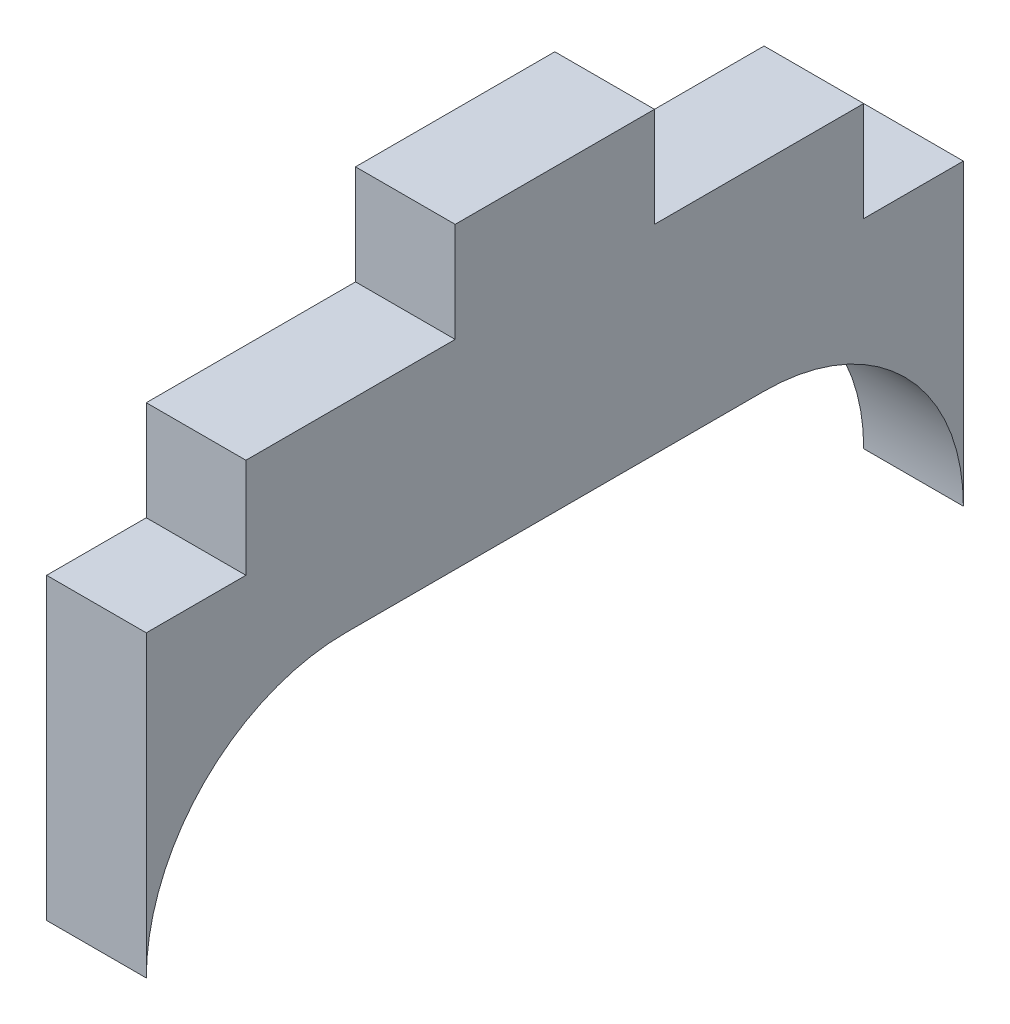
ISO-10303-21;
HEADER;
FILE_DESCRIPTION(('STEP AP214'),'2;1');
FILE_NAME('part.step','',(''),(''),'','','');
FILE_SCHEMA(('AUTOMOTIVE_DESIGN { 1 0 10303 214 1 1 1 1 }'));
ENDSEC;
DATA;
#1=APPLICATION_CONTEXT('core data for automotive mechanical design processes');
#2=APPLICATION_PROTOCOL_DEFINITION('international standard','automotive_design',2000,#1);
#3=PRODUCT_CONTEXT('',#1,'mechanical');
#4=PRODUCT('Part','Part','',(#3));
#5=PRODUCT_RELATED_PRODUCT_CATEGORY('part','',(#4));
#6=PRODUCT_DEFINITION_FORMATION('','',#4);
#7=PRODUCT_DEFINITION_CONTEXT('part definition',#1,'design');
#8=PRODUCT_DEFINITION('design','',#6,#7);
#9=PRODUCT_DEFINITION_SHAPE('','',#8);
#10=(LENGTH_UNIT() NAMED_UNIT(*) SI_UNIT(.MILLI.,.METRE.));
#11=(NAMED_UNIT(*) PLANE_ANGLE_UNIT() SI_UNIT($,.RADIAN.));
#12=(NAMED_UNIT(*) SI_UNIT($,.STERADIAN.) SOLID_ANGLE_UNIT());
#13=UNCERTAINTY_MEASURE_WITH_UNIT(LENGTH_MEASURE(1.E-05),#10,'distance_accuracy_value','');
#14=(GEOMETRIC_REPRESENTATION_CONTEXT(3) GLOBAL_UNCERTAINTY_ASSIGNED_CONTEXT((#13)) GLOBAL_UNIT_ASSIGNED_CONTEXT((#10,
#11,#12)) REPRESENTATION_CONTEXT('',''));
#15=CARTESIAN_POINT('',(0.,0.,0.));
#16=DIRECTION('',(0.,0.,1.));
#17=DIRECTION('',(1.,0.,0.));
#18=AXIS2_PLACEMENT_3D('',#15,#16,#17);
#19=CARTESIAN_POINT('',(5.,0.,-10.));
#20=DIRECTION('',(-1.,0.,0.));
#21=DIRECTION('',(0.,0.,1.));
#22=AXIS2_PLACEMENT_3D('',#19,#20,#21);
#23=CYLINDRICAL_SURFACE('',#22,10.);
#24=CARTESIAN_POINT('',(0.,0.,-10.));
#25=DIRECTION('',(-1.,0.,0.));
#26=DIRECTION('',(0.,0.,1.));
#27=AXIS2_PLACEMENT_3D('',#24,#25,#26);
#28=CIRCLE('',#27,10.);
#29=CARTESIAN_POINT('',(0.,0.,0.));
#30=VERTEX_POINT('',#29);
#31=CARTESIAN_POINT('',(0.,10.,-10.));
#32=VERTEX_POINT('',#31);
#33=EDGE_CURVE('E184',#30,#32,#28,.T.);
#34=ORIENTED_EDGE('',*,*,#33,.T.);
#35=DIRECTION('',(-1.,0.,0.));
#36=VECTOR('',#35,1.);
#37=CARTESIAN_POINT('',(5.,10.,-10.));
#38=LINE('',#37,#36);
#39=CARTESIAN_POINT('',(5.,10.,-10.));
#40=VERTEX_POINT('',#39);
#41=EDGE_CURVE('E11',#40,#32,#38,.T.);
#42=ORIENTED_EDGE('',*,*,#41,.F.);
#43=CARTESIAN_POINT('',(5.,0.,-10.));
#44=DIRECTION('',(-1.,0.,0.));
#45=DIRECTION('',(0.,0.,1.));
#46=AXIS2_PLACEMENT_3D('',#43,#44,#45);
#47=CIRCLE('',#46,10.);
#48=CARTESIAN_POINT('',(5.,0.,0.));
#49=VERTEX_POINT('',#48);
#50=EDGE_CURVE('E169',#49,#40,#47,.T.);
#51=ORIENTED_EDGE('',*,*,#50,.F.);
#52=DIRECTION('',(-1.,0.,0.));
#53=VECTOR('',#52,1.);
#54=CARTESIAN_POINT('',(5.,0.,0.));
#55=LINE('',#54,#53);
#56=EDGE_CURVE('E170',#49,#30,#55,.T.);
#57=ORIENTED_EDGE('',*,*,#56,.T.);
#58=EDGE_LOOP('',(#34,#42,#51,#57));
#59=FACE_BOUND('',#58,.T.);
#60=ADVANCED_FACE('F33',(#59),#23,.F.);
#61=CARTESIAN_POINT('',(5.,10.,-10.));
#62=DIRECTION('',(0.,1.,0.));
#63=DIRECTION('',(0.,0.,1.));
#64=AXIS2_PLACEMENT_3D('',#61,#62,#63);
#65=PLANE('',#64);
#66=DIRECTION('',(0.,0.,-1.));
#67=VECTOR('',#66,1.);
#68=CARTESIAN_POINT('',(0.,10.,-10.));
#69=LINE('',#68,#67);
#70=CARTESIAN_POINT('',(0.,10.,-31.));
#71=VERTEX_POINT('',#70);
#72=EDGE_CURVE('E164',#32,#71,#69,.T.);
#73=ORIENTED_EDGE('',*,*,#72,.T.);
#74=DIRECTION('',(-1.,0.,0.));
#75=VECTOR('',#74,1.);
#76=CARTESIAN_POINT('',(5.,10.,-31.));
#77=LINE('',#76,#75);
#78=CARTESIAN_POINT('',(5.,10.,-31.));
#79=VERTEX_POINT('',#78);
#80=EDGE_CURVE('E40',#79,#71,#77,.T.);
#81=ORIENTED_EDGE('',*,*,#80,.F.);
#82=DIRECTION('',(0.,0.,-1.));
#83=VECTOR('',#82,1.);
#84=CARTESIAN_POINT('',(5.,10.,-10.));
#85=LINE('',#84,#83);
#86=EDGE_CURVE('E187',#40,#79,#85,.T.);
#87=ORIENTED_EDGE('',*,*,#86,.F.);
#88=ORIENTED_EDGE('',*,*,#41,.T.);
#89=EDGE_LOOP('',(#73,#81,#87,#88));
#90=FACE_BOUND('',#89,.T.);
#91=ADVANCED_FACE('F186',(#90),#65,.F.);
#92=CARTESIAN_POINT('',(5.,0.,-31.));
#93=DIRECTION('',(-1.,0.,0.));
#94=DIRECTION('',(0.,0.,1.));
#95=AXIS2_PLACEMENT_3D('',#92,#93,#94);
#96=CYLINDRICAL_SURFACE('',#95,10.);
#97=CARTESIAN_POINT('',(0.,0.,-31.));
#98=DIRECTION('',(-1.,0.,0.));
#99=DIRECTION('',(0.,0.,1.));
#100=AXIS2_PLACEMENT_3D('',#97,#98,#99);
#101=CIRCLE('',#100,10.);
#102=CARTESIAN_POINT('',(0.,0.,-41.));
#103=VERTEX_POINT('',#102);
#104=EDGE_CURVE('E159',#71,#103,#101,.T.);
#105=ORIENTED_EDGE('',*,*,#104,.T.);
#106=DIRECTION('',(-1.,0.,0.));
#107=VECTOR('',#106,1.);
#108=CARTESIAN_POINT('',(5.,0.,-41.));
#109=LINE('',#108,#107);
#110=CARTESIAN_POINT('',(5.,0.,-41.));
#111=VERTEX_POINT('',#110);
#112=EDGE_CURVE('E157',#111,#103,#109,.T.);
#113=ORIENTED_EDGE('',*,*,#112,.F.);
#114=CARTESIAN_POINT('',(5.,0.,-31.));
#115=DIRECTION('',(-1.,0.,0.));
#116=DIRECTION('',(0.,0.,1.));
#117=AXIS2_PLACEMENT_3D('',#114,#115,#116);
#118=CIRCLE('',#117,10.);
#119=EDGE_CURVE('E179',#79,#111,#118,.T.);
#120=ORIENTED_EDGE('',*,*,#119,.F.);
#121=ORIENTED_EDGE('',*,*,#80,.T.);
#122=EDGE_LOOP('',(#105,#113,#120,#121));
#123=FACE_BOUND('',#122,.T.);
#124=ADVANCED_FACE('F178',(#123),#96,.F.);
#125=CARTESIAN_POINT('',(5.,25.,-41.));
#126=DIRECTION('',(0.,0.,1.));
#127=DIRECTION('',(1.,0.,0.));
#128=AXIS2_PLACEMENT_3D('',#125,#126,#127);
#129=PLANE('',#128);
#130=DIRECTION('',(0.,1.,0.));
#131=VECTOR('',#130,1.);
#132=CARTESIAN_POINT('',(0.,25.,-41.));
#133=LINE('',#132,#131);
#134=CARTESIAN_POINT('',(0.,15.,-41.));
#135=VERTEX_POINT('',#134);
#136=EDGE_CURVE('E150',#103,#135,#133,.T.);
#137=ORIENTED_EDGE('',*,*,#136,.T.);
#138=DIRECTION('',(1.,0.,0.));
#139=VECTOR('',#138,1.);
#140=CARTESIAN_POINT('',(-0.00100000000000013,15.,-41.));
#141=LINE('',#140,#139);
#142=CARTESIAN_POINT('',(5.,15.,-41.));
#143=VERTEX_POINT('',#142);
#144=EDGE_CURVE('E133',#135,#143,#141,.T.);
#145=ORIENTED_EDGE('',*,*,#144,.T.);
#146=DIRECTION('',(0.,1.,0.));
#147=VECTOR('',#146,1.);
#148=CARTESIAN_POINT('',(5.,25.,-41.));
#149=LINE('',#148,#147);
#150=EDGE_CURVE('E201',#111,#143,#149,.T.);
#151=ORIENTED_EDGE('',*,*,#150,.F.);
#152=ORIENTED_EDGE('',*,*,#112,.T.);
#153=EDGE_LOOP('',(#137,#145,#151,#152));
#154=FACE_BOUND('',#153,.T.);
#155=ADVANCED_FACE('F155',(#154),#129,.F.);
#156=CARTESIAN_POINT('',(5.,25.,0.));
#157=DIRECTION('',(0.,-1.,0.));
#158=DIRECTION('',(0.,0.,-1.));
#159=AXIS2_PLACEMENT_3D('',#156,#157,#158);
#160=PLANE('',#159);
#161=DIRECTION('',(0.,0.,1.));
#162=VECTOR('',#161,1.);
#163=CARTESIAN_POINT('',(0.,25.,0.));
#164=LINE('',#163,#162);
#165=CARTESIAN_POINT('',(0.,25.,-25.5));
#166=VERTEX_POINT('',#165);
#167=CARTESIAN_POINT('',(0.,25.,-15.5));
#168=VERTEX_POINT('',#167);
#169=EDGE_CURVE('E158',#166,#168,#164,.T.);
#170=ORIENTED_EDGE('',*,*,#169,.T.);
#171=DIRECTION('',(1.,0.,0.));
#172=VECTOR('',#171,1.);
#173=CARTESIAN_POINT('',(-0.00100000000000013,25.,-15.5));
#174=LINE('',#173,#172);
#175=CARTESIAN_POINT('',(5.,25.,-15.5));
#176=VERTEX_POINT('',#175);
#177=EDGE_CURVE('E194',#168,#176,#174,.T.);
#178=ORIENTED_EDGE('',*,*,#177,.T.);
#179=DIRECTION('',(0.,0.,1.));
#180=VECTOR('',#179,1.);
#181=CARTESIAN_POINT('',(5.,25.,0.));
#182=LINE('',#181,#180);
#183=CARTESIAN_POINT('',(5.,25.,-25.5));
#184=VERTEX_POINT('',#183);
#185=EDGE_CURVE('E198',#184,#176,#182,.T.);
#186=ORIENTED_EDGE('',*,*,#185,.F.);
#187=DIRECTION('',(1.,0.,0.));
#188=VECTOR('',#187,1.);
#189=CARTESIAN_POINT('',(-0.00100000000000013,25.,-25.5));
#190=LINE('',#189,#188);
#191=EDGE_CURVE('E209',#166,#184,#190,.T.);
#192=ORIENTED_EDGE('',*,*,#191,.F.);
#193=EDGE_LOOP('',(#170,#178,#186,#192));
#194=FACE_BOUND('',#193,.T.);
#195=ADVANCED_FACE('F280',(#194),#160,.F.);
#196=CARTESIAN_POINT('',(5.,0.,0.));
#197=DIRECTION('',(0.,0.,-1.));
#198=DIRECTION('',(-1.,0.,0.));
#199=AXIS2_PLACEMENT_3D('',#196,#197,#198);
#200=PLANE('',#199);
#201=DIRECTION('',(0.,-1.,0.));
#202=VECTOR('',#201,1.);
#203=CARTESIAN_POINT('',(5.,0.,0.));
#204=LINE('',#203,#202);
#205=CARTESIAN_POINT('',(5.,15.,0.));
#206=VERTEX_POINT('',#205);
#207=EDGE_CURVE('E173',#206,#49,#204,.T.);
#208=ORIENTED_EDGE('',*,*,#207,.F.);
#209=DIRECTION('',(1.,0.,0.));
#210=VECTOR('',#209,1.);
#211=CARTESIAN_POINT('',(-0.00100000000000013,15.,0.));
#212=LINE('',#211,#210);
#213=CARTESIAN_POINT('',(0.,15.,0.));
#214=VERTEX_POINT('',#213);
#215=EDGE_CURVE('E236',#214,#206,#212,.T.);
#216=ORIENTED_EDGE('',*,*,#215,.F.);
#217=DIRECTION('',(0.,-1.,0.));
#218=VECTOR('',#217,1.);
#219=CARTESIAN_POINT('',(0.,0.,0.));
#220=LINE('',#219,#218);
#221=EDGE_CURVE('E162',#214,#30,#220,.T.);
#222=ORIENTED_EDGE('',*,*,#221,.T.);
#223=ORIENTED_EDGE('',*,*,#56,.F.);
#224=EDGE_LOOP('',(#208,#216,#222,#223));
#225=FACE_BOUND('',#224,.T.);
#226=ADVANCED_FACE('F263',(#225),#200,.F.);
#227=CARTESIAN_POINT('',(5.,0.,-10.));
#228=DIRECTION('',(-1.,0.,0.));
#229=DIRECTION('',(0.,0.,1.));
#230=AXIS2_PLACEMENT_3D('',#227,#228,#229);
#231=PLANE('',#230);
#232=ORIENTED_EDGE('',*,*,#150,.T.);
#233=DIRECTION('',(0.,0.,-1.));
#234=VECTOR('',#233,1.);
#235=CARTESIAN_POINT('',(5.,15.,-41.));
#236=LINE('',#235,#234);
#237=CARTESIAN_POINT('',(5.,15.,-36.));
#238=VERTEX_POINT('',#237);
#239=EDGE_CURVE('E138',#238,#143,#236,.T.);
#240=ORIENTED_EDGE('',*,*,#239,.F.);
#241=DIRECTION('',(0.,-1.,0.));
#242=VECTOR('',#241,1.);
#243=CARTESIAN_POINT('',(5.,20.,-36.));
#244=LINE('',#243,#242);
#245=CARTESIAN_POINT('',(5.,20.,-36.));
#246=VERTEX_POINT('',#245);
#247=EDGE_CURVE('E152',#246,#238,#244,.T.);
#248=ORIENTED_EDGE('',*,*,#247,.F.);
#249=DIRECTION('',(0.,0.,-1.));
#250=VECTOR('',#249,1.);
#251=CARTESIAN_POINT('',(5.,20.,-25.5));
#252=LINE('',#251,#250);
#253=CARTESIAN_POINT('',(5.,20.,-25.5));
#254=VERTEX_POINT('',#253);
#255=EDGE_CURVE('E212',#254,#246,#252,.T.);
#256=ORIENTED_EDGE('',*,*,#255,.F.);
#257=DIRECTION('',(0.,-1.,0.));
#258=VECTOR('',#257,1.);
#259=CARTESIAN_POINT('',(5.,25.,-25.5));
#260=LINE('',#259,#258);
#261=EDGE_CURVE('E216',#184,#254,#260,.T.);
#262=ORIENTED_EDGE('',*,*,#261,.F.);
#263=ORIENTED_EDGE('',*,*,#185,.T.);
#264=DIRECTION('',(0.,1.,0.));
#265=VECTOR('',#264,1.);
#266=CARTESIAN_POINT('',(5.,25.,-15.5));
#267=LINE('',#266,#265);
#268=CARTESIAN_POINT('',(5.,20.,-15.5));
#269=VERTEX_POINT('',#268);
#270=EDGE_CURVE('E224',#269,#176,#267,.T.);
#271=ORIENTED_EDGE('',*,*,#270,.F.);
#272=DIRECTION('',(0.,0.,-1.));
#273=VECTOR('',#272,1.);
#274=CARTESIAN_POINT('',(5.,20.,0.));
#275=LINE('',#274,#273);
#276=CARTESIAN_POINT('',(5.,20.,-5.));
#277=VERTEX_POINT('',#276);
#278=EDGE_CURVE('E228',#277,#269,#275,.T.);
#279=ORIENTED_EDGE('',*,*,#278,.F.);
#280=DIRECTION('',(0.,1.,0.));
#281=VECTOR('',#280,1.);
#282=CARTESIAN_POINT('',(5.,20.,-5.));
#283=LINE('',#282,#281);
#284=CARTESIAN_POINT('',(5.,15.,-5.));
#285=VERTEX_POINT('',#284);
#286=EDGE_CURVE('E55',#285,#277,#283,.T.);
#287=ORIENTED_EDGE('',*,*,#286,.F.);
#288=DIRECTION('',(0.,0.,-1.));
#289=VECTOR('',#288,1.);
#290=CARTESIAN_POINT('',(5.,15.,0.));
#291=LINE('',#290,#289);
#292=EDGE_CURVE('E242',#206,#285,#291,.T.);
#293=ORIENTED_EDGE('',*,*,#292,.F.);
#294=ORIENTED_EDGE('',*,*,#207,.T.);
#295=ORIENTED_EDGE('',*,*,#50,.T.);
#296=ORIENTED_EDGE('',*,*,#86,.T.);
#297=ORIENTED_EDGE('',*,*,#119,.T.);
#298=EDGE_LOOP('',(#232,#240,#248,#256,#262,#263,#271,#279,#287,#293,#294,#295,#296,#297));
#299=FACE_BOUND('',#298,.T.);
#300=ADVANCED_FACE('F258',(#299),#231,.F.);
#301=CARTESIAN_POINT('',(0.,0.,-10.));
#302=DIRECTION('',(-1.,0.,0.));
#303=DIRECTION('',(0.,0.,1.));
#304=AXIS2_PLACEMENT_3D('',#301,#302,#303);
#305=PLANE('',#304);
#306=DIRECTION('',(0.,0.,-1.));
#307=VECTOR('',#306,1.);
#308=CARTESIAN_POINT('',(0.,15.,-41.));
#309=LINE('',#308,#307);
#310=CARTESIAN_POINT('',(0.,15.,-36.));
#311=VERTEX_POINT('',#310);
#312=EDGE_CURVE('E136',#311,#135,#309,.T.);
#313=ORIENTED_EDGE('',*,*,#312,.T.);
#314=ORIENTED_EDGE('',*,*,#136,.F.);
#315=ORIENTED_EDGE('',*,*,#104,.F.);
#316=ORIENTED_EDGE('',*,*,#72,.F.);
#317=ORIENTED_EDGE('',*,*,#33,.F.);
#318=ORIENTED_EDGE('',*,*,#221,.F.);
#319=DIRECTION('',(0.,0.,-1.));
#320=VECTOR('',#319,1.);
#321=CARTESIAN_POINT('',(0.,15.,0.));
#322=LINE('',#321,#320);
#323=CARTESIAN_POINT('',(0.,15.,-5.));
#324=VERTEX_POINT('',#323);
#325=EDGE_CURVE('E232',#214,#324,#322,.T.);
#326=ORIENTED_EDGE('',*,*,#325,.T.);
#327=DIRECTION('',(0.,1.,0.));
#328=VECTOR('',#327,1.);
#329=CARTESIAN_POINT('',(0.,20.,-5.));
#330=LINE('',#329,#328);
#331=CARTESIAN_POINT('',(0.,20.,-5.));
#332=VERTEX_POINT('',#331);
#333=EDGE_CURVE('E245',#324,#332,#330,.T.);
#334=ORIENTED_EDGE('',*,*,#333,.T.);
#335=DIRECTION('',(0.,0.,-1.));
#336=VECTOR('',#335,1.);
#337=CARTESIAN_POINT('',(0.,20.,0.));
#338=LINE('',#337,#336);
#339=CARTESIAN_POINT('',(0.,20.,-15.5));
#340=VERTEX_POINT('',#339);
#341=EDGE_CURVE('E192',#332,#340,#338,.T.);
#342=ORIENTED_EDGE('',*,*,#341,.T.);
#343=DIRECTION('',(0.,1.,0.));
#344=VECTOR('',#343,1.);
#345=CARTESIAN_POINT('',(0.,25.,-15.5));
#346=LINE('',#345,#344);
#347=EDGE_CURVE('E208',#340,#168,#346,.T.);
#348=ORIENTED_EDGE('',*,*,#347,.T.);
#349=ORIENTED_EDGE('',*,*,#169,.F.);
#350=DIRECTION('',(0.,-1.,0.));
#351=VECTOR('',#350,1.);
#352=CARTESIAN_POINT('',(0.,25.,-25.5));
#353=LINE('',#352,#351);
#354=CARTESIAN_POINT('',(0.,20.,-25.5));
#355=VERTEX_POINT('',#354);
#356=EDGE_CURVE('E143',#166,#355,#353,.T.);
#357=ORIENTED_EDGE('',*,*,#356,.T.);
#358=DIRECTION('',(0.,0.,-1.));
#359=VECTOR('',#358,1.);
#360=CARTESIAN_POINT('',(0.,20.,-25.5));
#361=LINE('',#360,#359);
#362=CARTESIAN_POINT('',(0.,20.,-36.));
#363=VERTEX_POINT('',#362);
#364=EDGE_CURVE('E206',#355,#363,#361,.T.);
#365=ORIENTED_EDGE('',*,*,#364,.T.);
#366=DIRECTION('',(0.,-1.,0.));
#367=VECTOR('',#366,1.);
#368=CARTESIAN_POINT('',(0.,20.,-36.));
#369=LINE('',#368,#367);
#370=EDGE_CURVE('E47',#363,#311,#369,.T.);
#371=ORIENTED_EDGE('',*,*,#370,.T.);
#372=EDGE_LOOP('',(#313,#314,#315,#316,#317,#318,#326,#334,#342,#348,#349,#357,#365,#371));
#373=FACE_BOUND('',#372,.T.);
#374=ADVANCED_FACE('F148',(#373),#305,.T.);
#375=CARTESIAN_POINT('',(-0.00100000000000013,25.,-25.5));
#376=DIRECTION('',(0.,0.,1.));
#377=DIRECTION('',(1.,0.,0.));
#378=AXIS2_PLACEMENT_3D('',#375,#376,#377);
#379=PLANE('',#378);
#380=ORIENTED_EDGE('',*,*,#191,.T.);
#381=ORIENTED_EDGE('',*,*,#261,.T.);
#382=DIRECTION('',(1.,0.,0.));
#383=VECTOR('',#382,1.);
#384=CARTESIAN_POINT('',(-0.00100000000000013,20.,-25.5));
#385=LINE('',#384,#383);
#386=EDGE_CURVE('E210',#355,#254,#385,.T.);
#387=ORIENTED_EDGE('',*,*,#386,.F.);
#388=ORIENTED_EDGE('',*,*,#356,.F.);
#389=EDGE_LOOP('',(#380,#381,#387,#388));
#390=FACE_BOUND('',#389,.T.);
#391=ADVANCED_FACE('F285',(#390),#379,.F.);
#392=CARTESIAN_POINT('',(-0.00100000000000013,20.,-25.5));
#393=DIRECTION('',(0.,-1.,0.));
#394=DIRECTION('',(0.,0.,-1.));
#395=AXIS2_PLACEMENT_3D('',#392,#393,#394);
#396=PLANE('',#395);
#397=ORIENTED_EDGE('',*,*,#255,.T.);
#398=DIRECTION('',(1.,0.,0.));
#399=VECTOR('',#398,1.);
#400=CARTESIAN_POINT('',(-0.00100000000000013,20.,-36.));
#401=LINE('',#400,#399);
#402=EDGE_CURVE('E248',#363,#246,#401,.T.);
#403=ORIENTED_EDGE('',*,*,#402,.F.);
#404=ORIENTED_EDGE('',*,*,#364,.F.);
#405=ORIENTED_EDGE('',*,*,#386,.T.);
#406=EDGE_LOOP('',(#397,#403,#404,#405));
#407=FACE_BOUND('',#406,.T.);
#408=ADVANCED_FACE('F287',(#407),#396,.F.);
#409=CARTESIAN_POINT('',(-0.00100000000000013,25.,-15.5));
#410=DIRECTION('',(0.,0.,-1.));
#411=DIRECTION('',(-1.,0.,0.));
#412=AXIS2_PLACEMENT_3D('',#409,#410,#411);
#413=PLANE('',#412);
#414=DIRECTION('',(1.,0.,0.));
#415=VECTOR('',#414,1.);
#416=CARTESIAN_POINT('',(-0.00100000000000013,20.,-15.5));
#417=LINE('',#416,#415);
#418=EDGE_CURVE('E221',#340,#269,#417,.T.);
#419=ORIENTED_EDGE('',*,*,#418,.T.);
#420=ORIENTED_EDGE('',*,*,#270,.T.);
#421=ORIENTED_EDGE('',*,*,#177,.F.);
#422=ORIENTED_EDGE('',*,*,#347,.F.);
#423=EDGE_LOOP('',(#419,#420,#421,#422));
#424=FACE_BOUND('',#423,.T.);
#425=ADVANCED_FACE('F277',(#424),#413,.F.);
#426=CARTESIAN_POINT('',(-0.00100000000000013,20.,0.));
#427=DIRECTION('',(0.,-1.,0.));
#428=DIRECTION('',(0.,0.,-1.));
#429=AXIS2_PLACEMENT_3D('',#426,#427,#428);
#430=PLANE('',#429);
#431=ORIENTED_EDGE('',*,*,#341,.F.);
#432=DIRECTION('',(1.,0.,0.));
#433=VECTOR('',#432,1.);
#434=CARTESIAN_POINT('',(-0.00100000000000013,20.,-5.));
#435=LINE('',#434,#433);
#436=EDGE_CURVE('E235',#332,#277,#435,.T.);
#437=ORIENTED_EDGE('',*,*,#436,.T.);
#438=ORIENTED_EDGE('',*,*,#278,.T.);
#439=ORIENTED_EDGE('',*,*,#418,.F.);
#440=EDGE_LOOP('',(#431,#437,#438,#439));
#441=FACE_BOUND('',#440,.T.);
#442=ADVANCED_FACE('F271',(#441),#430,.F.);
#443=CARTESIAN_POINT('',(-0.00100000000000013,20.,-5.));
#444=DIRECTION('',(0.,0.,-1.));
#445=DIRECTION('',(0.,1.,0.));
#446=AXIS2_PLACEMENT_3D('',#443,#444,#445);
#447=PLANE('',#446);
#448=DIRECTION('',(1.,0.,0.));
#449=VECTOR('',#448,1.);
#450=CARTESIAN_POINT('',(-0.00100000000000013,15.,-5.));
#451=LINE('',#450,#449);
#452=EDGE_CURVE('E238',#324,#285,#451,.T.);
#453=ORIENTED_EDGE('',*,*,#452,.T.);
#454=ORIENTED_EDGE('',*,*,#286,.T.);
#455=ORIENTED_EDGE('',*,*,#436,.F.);
#456=ORIENTED_EDGE('',*,*,#333,.F.);
#457=EDGE_LOOP('',(#453,#454,#455,#456));
#458=FACE_BOUND('',#457,.T.);
#459=ADVANCED_FACE('F268',(#458),#447,.F.);
#460=CARTESIAN_POINT('',(-0.00100000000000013,15.,0.));
#461=DIRECTION('',(0.,-1.,0.));
#462=DIRECTION('',(0.,0.,-1.));
#463=AXIS2_PLACEMENT_3D('',#460,#461,#462);
#464=PLANE('',#463);
#465=ORIENTED_EDGE('',*,*,#215,.T.);
#466=ORIENTED_EDGE('',*,*,#292,.T.);
#467=ORIENTED_EDGE('',*,*,#452,.F.);
#468=ORIENTED_EDGE('',*,*,#325,.F.);
#469=EDGE_LOOP('',(#465,#466,#467,#468));
#470=FACE_BOUND('',#469,.T.);
#471=ADVANCED_FACE('F267',(#470),#464,.F.);
#472=CARTESIAN_POINT('',(-0.00100000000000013,15.,-41.));
#473=DIRECTION('',(0.,-1.,0.));
#474=DIRECTION('',(0.,0.,-1.));
#475=AXIS2_PLACEMENT_3D('',#472,#473,#474);
#476=PLANE('',#475);
#477=DIRECTION('',(1.,0.,0.));
#478=VECTOR('',#477,1.);
#479=CARTESIAN_POINT('',(-0.00100000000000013,15.,-36.));
#480=LINE('',#479,#478);
#481=EDGE_CURVE('E144',#311,#238,#480,.T.);
#482=ORIENTED_EDGE('',*,*,#481,.T.);
#483=ORIENTED_EDGE('',*,*,#239,.T.);
#484=ORIENTED_EDGE('',*,*,#144,.F.);
#485=ORIENTED_EDGE('',*,*,#312,.F.);
#486=EDGE_LOOP('',(#482,#483,#484,#485));
#487=FACE_BOUND('',#486,.T.);
#488=ADVANCED_FACE('F135',(#487),#476,.F.);
#489=CARTESIAN_POINT('',(-0.00100000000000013,20.,-36.));
#490=DIRECTION('',(0.,0.,1.));
#491=DIRECTION('',(1.,0.,0.));
#492=AXIS2_PLACEMENT_3D('',#489,#490,#491);
#493=PLANE('',#492);
#494=ORIENTED_EDGE('',*,*,#402,.T.);
#495=ORIENTED_EDGE('',*,*,#247,.T.);
#496=ORIENTED_EDGE('',*,*,#481,.F.);
#497=ORIENTED_EDGE('',*,*,#370,.F.);
#498=EDGE_LOOP('',(#494,#495,#496,#497));
#499=FACE_BOUND('',#498,.T.);
#500=ADVANCED_FACE('F255',(#499),#493,.F.);
#501=CLOSED_SHELL('',(#60,#91,#124,#155,#195,#226,#300,#374,#391,#408,#425,#442,#459,#471,#488,#500));
#502=MANIFOLD_SOLID_BREP('B2',#501);
#503=ADVANCED_BREP_SHAPE_REPRESENTATION('',(#18,#502),#14);
#504=SHAPE_DEFINITION_REPRESENTATION(#9,#503);
ENDSEC;
END-ISO-10303-21;
